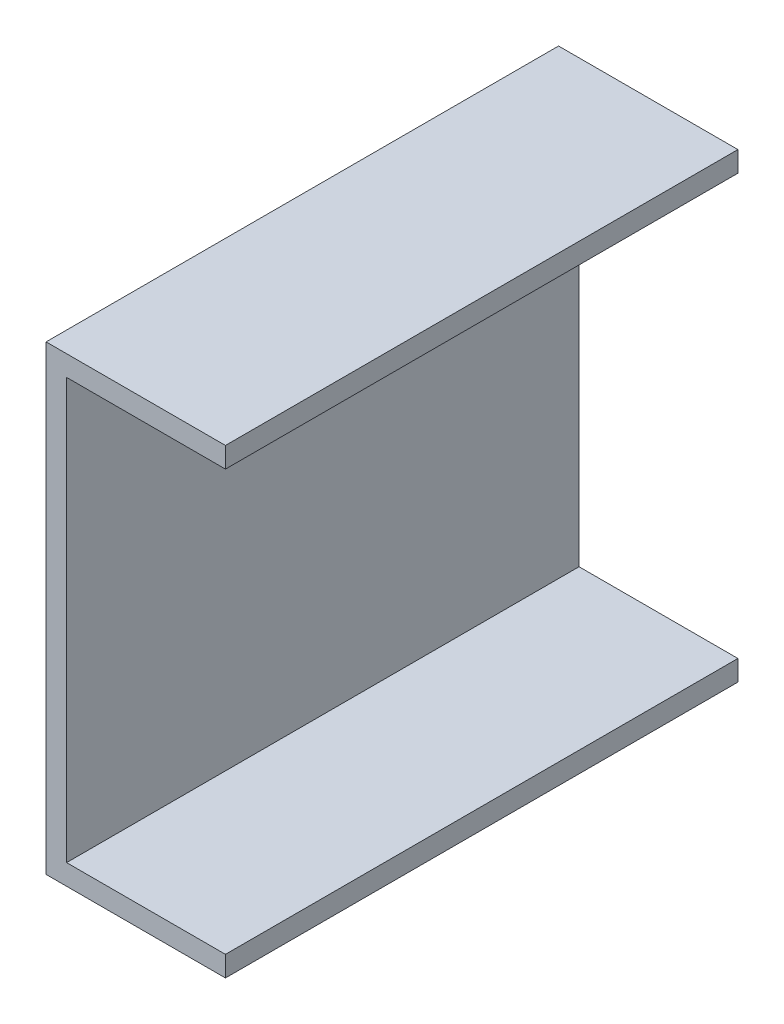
from build123d import *

# Parameters (mm, degrees)
LINEAR_AUSTRAGEN1_DEPTH = 200


with BuildPart() as part:
    # Skizze1 → Linear austragen1 (new body)
    with BuildSketch(Plane.XY):
        Polygon((8, 8), (8, 172), (70, 172), (70, 180), (0, 180), (0, 0), (70, 0), (70, 8), align=None)
    extrude(amount=LINEAR_AUSTRAGEN1_DEPTH)


solid = part.part
